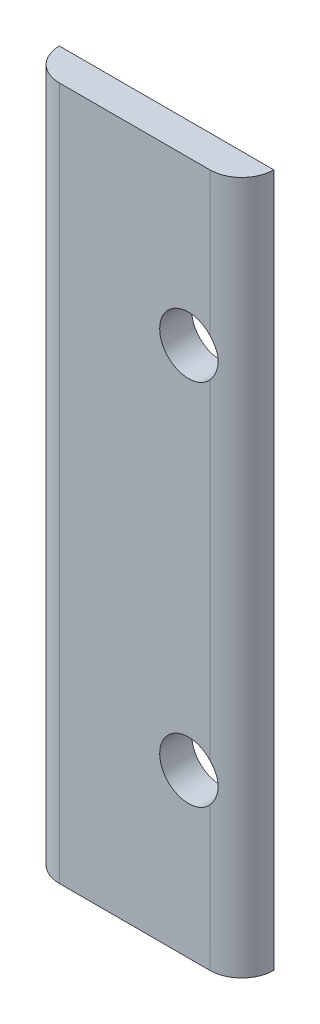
ISO-10303-21;
HEADER;
FILE_DESCRIPTION(('STEP AP214'),'2;1');
FILE_NAME('part.step','',(''),(''),'','','');
FILE_SCHEMA(('AUTOMOTIVE_DESIGN { 1 0 10303 214 1 1 1 1 }'));
ENDSEC;
DATA;
#1=APPLICATION_CONTEXT('core data for automotive mechanical design processes');
#2=APPLICATION_PROTOCOL_DEFINITION('international standard','automotive_design',2000,#1);
#3=PRODUCT_CONTEXT('',#1,'mechanical');
#4=PRODUCT('Part','Part','',(#3));
#5=PRODUCT_RELATED_PRODUCT_CATEGORY('part','',(#4));
#6=PRODUCT_DEFINITION_FORMATION('','',#4);
#7=PRODUCT_DEFINITION_CONTEXT('part definition',#1,'design');
#8=PRODUCT_DEFINITION('design','',#6,#7);
#9=PRODUCT_DEFINITION_SHAPE('','',#8);
#10=(LENGTH_UNIT() NAMED_UNIT(*) SI_UNIT(.MILLI.,.METRE.));
#11=(NAMED_UNIT(*) PLANE_ANGLE_UNIT() SI_UNIT($,.RADIAN.));
#12=(NAMED_UNIT(*) SI_UNIT($,.STERADIAN.) SOLID_ANGLE_UNIT());
#13=UNCERTAINTY_MEASURE_WITH_UNIT(LENGTH_MEASURE(1.E-05),#10,'distance_accuracy_value','');
#14=(GEOMETRIC_REPRESENTATION_CONTEXT(3) GLOBAL_UNCERTAINTY_ASSIGNED_CONTEXT((#13)) GLOBAL_UNIT_ASSIGNED_CONTEXT((#10,
#11,#12)) REPRESENTATION_CONTEXT('',''));
#15=CARTESIAN_POINT('',(0.,0.,0.));
#16=DIRECTION('',(0.,0.,1.));
#17=DIRECTION('',(1.,0.,0.));
#18=AXIS2_PLACEMENT_3D('',#15,#16,#17);
#19=CARTESIAN_POINT('',(60.,32.5,3.));
#20=DIRECTION('',(0.,-1.,0.));
#21=DIRECTION('',(0.,0.,-1.));
#22=AXIS2_PLACEMENT_3D('',#19,#20,#21);
#23=PLANE('',#22);
#24=DIRECTION('',(-1.,0.,0.));
#25=VECTOR('',#24,1.);
#26=CARTESIAN_POINT('',(60.,32.5,0.));
#27=LINE('',#26,#25);
#28=CARTESIAN_POINT('',(60.,32.5,0.));
#29=VERTEX_POINT('',#28);
#30=CARTESIAN_POINT('',(39.8952376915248,32.5,0.));
#31=VERTEX_POINT('',#30);
#32=EDGE_CURVE('E96',#29,#31,#27,.T.);
#33=ORIENTED_EDGE('',*,*,#32,.T.);
#34=CARTESIAN_POINT('',(42.8952376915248,32.5,0.));
#35=DIRECTION('',(0.,-1.,0.));
#36=DIRECTION('',(0.,0.,-1.));
#37=AXIS2_PLACEMENT_3D('',#34,#35,#36);
#38=CIRCLE('',#37,3.);
#39=CARTESIAN_POINT('',(42.8952376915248,32.5,3.));
#40=VERTEX_POINT('',#39);
#41=EDGE_CURVE('E103',#31,#40,#38,.F.);
#42=ORIENTED_EDGE('',*,*,#41,.T.);
#43=DIRECTION('',(-1.,0.,0.));
#44=VECTOR('',#43,1.);
#45=CARTESIAN_POINT('',(60.,32.5,3.));
#46=LINE('',#45,#44);
#47=CARTESIAN_POINT('',(57.,32.5,3.));
#48=VERTEX_POINT('',#47);
#49=EDGE_CURVE('E159',#48,#40,#46,.T.);
#50=ORIENTED_EDGE('',*,*,#49,.F.);
#51=CARTESIAN_POINT('',(57.,32.5,0.));
#52=DIRECTION('',(0.,-1.,0.));
#53=DIRECTION('',(0.,0.,-1.));
#54=AXIS2_PLACEMENT_3D('',#51,#52,#53);
#55=CIRCLE('',#54,3.);
#56=EDGE_CURVE('E106',#48,#29,#55,.F.);
#57=ORIENTED_EDGE('',*,*,#56,.T.);
#58=EDGE_LOOP('',(#33,#42,#50,#57));
#59=FACE_BOUND('',#58,.T.);
#60=ADVANCED_FACE('F33',(#59),#23,.F.);
#61=CARTESIAN_POINT('',(39.8952376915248,-32.5,3.));
#62=DIRECTION('',(0.,1.,0.));
#63=DIRECTION('',(0.,0.,1.));
#64=AXIS2_PLACEMENT_3D('',#61,#62,#63);
#65=PLANE('',#64);
#66=DIRECTION('',(1.,0.,0.));
#67=VECTOR('',#66,1.);
#68=CARTESIAN_POINT('',(39.8952376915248,-32.5,3.));
#69=LINE('',#68,#67);
#70=CARTESIAN_POINT('',(42.8952376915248,-32.5,3.));
#71=VERTEX_POINT('',#70);
#72=CARTESIAN_POINT('',(57.,-32.5,3.));
#73=VERTEX_POINT('',#72);
#74=EDGE_CURVE('E157',#71,#73,#69,.T.);
#75=ORIENTED_EDGE('',*,*,#74,.F.);
#76=CARTESIAN_POINT('',(42.8952376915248,-32.5,0.));
#77=DIRECTION('',(0.,1.,0.));
#78=DIRECTION('',(0.,0.,1.));
#79=AXIS2_PLACEMENT_3D('',#76,#77,#78);
#80=CIRCLE('',#79,3.);
#81=CARTESIAN_POINT('',(39.8952376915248,-32.5,0.));
#82=VERTEX_POINT('',#81);
#83=EDGE_CURVE('E61',#71,#82,#80,.F.);
#84=ORIENTED_EDGE('',*,*,#83,.T.);
#85=DIRECTION('',(1.,0.,0.));
#86=VECTOR('',#85,1.);
#87=CARTESIAN_POINT('',(39.8952376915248,-32.5,0.));
#88=LINE('',#87,#86);
#89=CARTESIAN_POINT('',(60.,-32.5,0.));
#90=VERTEX_POINT('',#89);
#91=EDGE_CURVE('E98',#82,#90,#88,.T.);
#92=ORIENTED_EDGE('',*,*,#91,.T.);
#93=CARTESIAN_POINT('',(57.,-32.5,0.));
#94=DIRECTION('',(0.,1.,0.));
#95=DIRECTION('',(0.,0.,1.));
#96=AXIS2_PLACEMENT_3D('',#93,#94,#95);
#97=CIRCLE('',#96,3.);
#98=EDGE_CURVE('E53',#90,#73,#97,.F.);
#99=ORIENTED_EDGE('',*,*,#98,.T.);
#100=EDGE_LOOP('',(#75,#84,#92,#99));
#101=FACE_BOUND('',#100,.T.);
#102=ADVANCED_FACE('F130',(#101),#65,.F.);
#103=CARTESIAN_POINT('',(0.,0.,3.));
#104=DIRECTION('',(0.,0.,1.));
#105=DIRECTION('',(1.,0.,0.));
#106=AXIS2_PLACEMENT_3D('',#103,#104,#105);
#107=PLANE('',#106);
#108=ORIENTED_EDGE('',*,*,#49,.T.);
#109=DIRECTION('',(0.,-1.,0.));
#110=VECTOR('',#109,1.);
#111=CARTESIAN_POINT('',(42.8952376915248,-32.5,3.));
#112=LINE('',#111,#110);
#113=EDGE_CURVE('E110',#40,#71,#112,.T.);
#114=ORIENTED_EDGE('',*,*,#113,.T.);
#115=ORIENTED_EDGE('',*,*,#74,.T.);
#116=DIRECTION('',(0.,1.,0.));
#117=VECTOR('',#116,1.);
#118=CARTESIAN_POINT('',(57.,32.5,3.));
#119=LINE('',#118,#117);
#120=CARTESIAN_POINT('',(57.,-19.0638357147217,3.));
#121=VERTEX_POINT('',#120);
#122=EDGE_CURVE('E148',#73,#121,#119,.T.);
#123=ORIENTED_EDGE('',*,*,#122,.T.);
#124=CARTESIAN_POINT('',(55.,-17.25,3.));
#125=DIRECTION('',(0.,0.,-1.));
#126=DIRECTION('',(-1.,0.,0.));
#127=AXIS2_PLACEMENT_3D('',#124,#125,#126);
#128=CIRCLE('',#127,2.7);
#129=CARTESIAN_POINT('',(57.,-15.4361642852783,3.));
#130=VERTEX_POINT('',#129);
#131=EDGE_CURVE('E166',#121,#130,#128,.T.);
#132=ORIENTED_EDGE('',*,*,#131,.T.);
#133=DIRECTION('',(0.,1.,0.));
#134=VECTOR('',#133,1.);
#135=CARTESIAN_POINT('',(57.,32.5,3.));
#136=LINE('',#135,#134);
#137=CARTESIAN_POINT('',(57.,15.4361642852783,3.));
#138=VERTEX_POINT('',#137);
#139=EDGE_CURVE('E153',#130,#138,#136,.T.);
#140=ORIENTED_EDGE('',*,*,#139,.T.);
#141=CARTESIAN_POINT('',(55.,17.25,3.));
#142=DIRECTION('',(0.,0.,-1.));
#143=DIRECTION('',(-1.,0.,0.));
#144=AXIS2_PLACEMENT_3D('',#141,#142,#143);
#145=CIRCLE('',#144,2.7);
#146=CARTESIAN_POINT('',(57.,19.0638357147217,3.));
#147=VERTEX_POINT('',#146);
#148=EDGE_CURVE('E107',#138,#147,#145,.T.);
#149=ORIENTED_EDGE('',*,*,#148,.T.);
#150=DIRECTION('',(0.,1.,0.));
#151=VECTOR('',#150,1.);
#152=CARTESIAN_POINT('',(57.,32.5,3.));
#153=LINE('',#152,#151);
#154=EDGE_CURVE('E155',#147,#48,#153,.T.);
#155=ORIENTED_EDGE('',*,*,#154,.T.);
#156=EDGE_LOOP('',(#108,#114,#115,#123,#132,#140,#149,#155));
#157=FACE_BOUND('',#156,.T.);
#158=ADVANCED_FACE('F127',(#157),#107,.T.);
#159=CARTESIAN_POINT('',(0.,0.,0.));
#160=DIRECTION('',(0.,0.,1.));
#161=DIRECTION('',(1.,0.,0.));
#162=AXIS2_PLACEMENT_3D('',#159,#160,#161);
#163=PLANE('',#162);
#164=CARTESIAN_POINT('',(55.,-17.25,0.));
#165=DIRECTION('',(0.,0.,-1.));
#166=DIRECTION('',(-1.,0.,0.));
#167=AXIS2_PLACEMENT_3D('',#164,#165,#166);
#168=CIRCLE('',#167,2.7);
#169=CARTESIAN_POINT('',(52.3,-17.25,0.));
#170=VERTEX_POINT('',#169);
#171=EDGE_CURVE('E169',#170,#170,#168,.T.);
#172=ORIENTED_EDGE('',*,*,#171,.F.);
#173=EDGE_LOOP('',(#172));
#174=FACE_BOUND('',#173,.T.);
#175=CARTESIAN_POINT('',(55.,17.25,0.));
#176=DIRECTION('',(0.,0.,-1.));
#177=DIRECTION('',(-1.,0.,0.));
#178=AXIS2_PLACEMENT_3D('',#175,#176,#177);
#179=CIRCLE('',#178,2.7);
#180=CARTESIAN_POINT('',(52.3,17.25,0.));
#181=VERTEX_POINT('',#180);
#182=EDGE_CURVE('E163',#181,#181,#179,.T.);
#183=ORIENTED_EDGE('',*,*,#182,.F.);
#184=EDGE_LOOP('',(#183));
#185=FACE_BOUND('',#184,.T.);
#186=ORIENTED_EDGE('',*,*,#32,.F.);
#187=DIRECTION('',(0.,1.,0.));
#188=VECTOR('',#187,1.);
#189=CARTESIAN_POINT('',(60.,-32.5,0.));
#190=LINE('',#189,#188);
#191=EDGE_CURVE('E146',#90,#29,#190,.T.);
#192=ORIENTED_EDGE('',*,*,#191,.F.);
#193=ORIENTED_EDGE('',*,*,#91,.F.);
#194=DIRECTION('',(0.,-1.,0.));
#195=VECTOR('',#194,1.);
#196=CARTESIAN_POINT('',(39.8952376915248,32.5,0.));
#197=LINE('',#196,#195);
#198=EDGE_CURVE('E92',#31,#82,#197,.T.);
#199=ORIENTED_EDGE('',*,*,#198,.F.);
#200=EDGE_LOOP('',(#186,#192,#193,#199));
#201=FACE_BOUND('',#200,.T.);
#202=ADVANCED_FACE('F94',(#174,#185,#201),#163,.F.);
#203=CARTESIAN_POINT('',(55.,17.25,3.));
#204=DIRECTION('',(0.,0.,-1.));
#205=DIRECTION('',(-1.,0.,0.));
#206=AXIS2_PLACEMENT_3D('',#203,#204,#205);
#207=CYLINDRICAL_SURFACE('',#206,2.7);
#208=ORIENTED_EDGE('',*,*,#148,.F.);
#209=CARTESIAN_POINT('',(57.,15.4361642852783,3.));
#210=CARTESIAN_POINT('',(57.0507106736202,15.4920778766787,2.99999658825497));
#211=CARTESIAN_POINT('',(57.0990361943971,15.5500792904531,2.9987150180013));
#212=CARTESIAN_POINT('',(57.1906194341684,15.6698514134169,2.99428920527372));
#213=CARTESIAN_POINT('',(57.2338793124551,15.7316204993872,2.99114575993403));
#214=CARTESIAN_POINT('',(57.3556045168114,15.9219319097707,2.97996673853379));
#215=CARTESIAN_POINT('',(57.4261066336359,16.0555792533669,2.97018000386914));
#216=CARTESIAN_POINT('',(57.5438335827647,16.3326219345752,2.95090232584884));
#217=CARTESIAN_POINT('',(57.5910694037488,16.4760126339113,2.94141124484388));
#218=CARTESIAN_POINT('',(57.6610244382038,16.7687940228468,2.92648965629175));
#219=CARTESIAN_POINT('',(57.6837625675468,16.9181799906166,2.92105601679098));
#220=CARTESIAN_POINT('',(57.7040123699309,17.2186654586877,2.9162447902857));
#221=CARTESIAN_POINT('',(57.7015391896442,17.3697638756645,2.91686356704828));
#222=CARTESIAN_POINT('',(57.6714760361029,17.6694090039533,2.92392654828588));
#223=CARTESIAN_POINT('',(57.6438666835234,17.8179536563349,2.9303752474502));
#224=CARTESIAN_POINT('',(57.5649489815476,18.1062101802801,2.94659382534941));
#225=CARTESIAN_POINT('',(57.5139625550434,18.2460136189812,2.95631812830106));
#226=CARTESIAN_POINT('',(57.3897740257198,18.5152620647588,2.97522975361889));
#227=CARTESIAN_POINT('',(57.3166072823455,18.6447231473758,2.98441790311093));
#228=CARTESIAN_POINT('',(57.1979643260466,18.8193729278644,2.9936704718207));
#229=CARTESIAN_POINT('',(57.1607623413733,18.8702088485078,2.99594306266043));
#230=CARTESIAN_POINT('',(57.0829226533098,18.9691230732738,2.99910636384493));
#231=CARTESIAN_POINT('',(57.0422891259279,19.0172046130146,2.99999872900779));
#232=CARTESIAN_POINT('',(57.,19.0638357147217,3.));
#233=B_SPLINE_CURVE_WITH_KNOTS('',3,(#209,#210,#211,#212,#213,#214,#215,#216,#217,#218,#219,
#220,#221,#222,#223,#224,#225,#226,#227,#228,#229,#230,#231,#232),.UNSPECIFIED.,.F.,.F.,(4,2,2,
2,2,2,2,2,2,2,2,4),(0.,0.226277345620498,0.452457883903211,0.904416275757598,1.35616100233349,
1.80755666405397,2.25868114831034,2.71015373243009,3.15558769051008,3.60031524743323,
3.78928090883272,3.97801983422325),.UNSPECIFIED.);
#234=EDGE_CURVE('E11',#138,#147,#233,.T.);
#235=ORIENTED_EDGE('',*,*,#234,.T.);
#236=EDGE_LOOP('',(#208,#235));
#237=FACE_BOUND('',#236,.T.);
#238=ORIENTED_EDGE('',*,*,#182,.T.);
#239=EDGE_LOOP('',(#238));
#240=FACE_BOUND('',#239,.T.);
#241=ADVANCED_FACE('F121',(#237,#240),#207,.F.);
#242=CARTESIAN_POINT('',(55.,-17.25,3.));
#243=DIRECTION('',(0.,0.,-1.));
#244=DIRECTION('',(-1.,0.,0.));
#245=AXIS2_PLACEMENT_3D('',#242,#243,#244);
#246=CYLINDRICAL_SURFACE('',#245,2.7);
#247=ORIENTED_EDGE('',*,*,#131,.F.);
#248=CARTESIAN_POINT('',(57.,-19.0638357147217,3.));
#249=CARTESIAN_POINT('',(57.0507106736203,-19.0079221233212,2.99999658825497));
#250=CARTESIAN_POINT('',(57.0990361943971,-18.9499207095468,2.9987150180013));
#251=CARTESIAN_POINT('',(57.1906194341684,-18.8301485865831,2.99428920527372));
#252=CARTESIAN_POINT('',(57.2338793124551,-18.7683795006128,2.99114575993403));
#253=CARTESIAN_POINT('',(57.3556045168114,-18.5780680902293,2.97996673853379));
#254=CARTESIAN_POINT('',(57.4261066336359,-18.4444207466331,2.97018000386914));
#255=CARTESIAN_POINT('',(57.5438335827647,-18.1673780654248,2.95090232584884));
#256=CARTESIAN_POINT('',(57.5910694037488,-18.0239873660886,2.94141124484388));
#257=CARTESIAN_POINT('',(57.6610244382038,-17.7312059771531,2.92648965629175));
#258=CARTESIAN_POINT('',(57.6837625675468,-17.5818200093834,2.92105601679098));
#259=CARTESIAN_POINT('',(57.7040123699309,-17.2813345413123,2.9162447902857));
#260=CARTESIAN_POINT('',(57.7015391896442,-17.1302361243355,2.91686356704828));
#261=CARTESIAN_POINT('',(57.6714760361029,-16.8305909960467,2.92392654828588));
#262=CARTESIAN_POINT('',(57.6438666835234,-16.6820463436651,2.9303752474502));
#263=CARTESIAN_POINT('',(57.5649489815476,-16.3937898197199,2.94659382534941));
#264=CARTESIAN_POINT('',(57.5139625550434,-16.2539863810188,2.95631812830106));
#265=CARTESIAN_POINT('',(57.3897740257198,-15.9847379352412,2.97522975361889));
#266=CARTESIAN_POINT('',(57.3166072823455,-15.8552768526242,2.98441790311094));
#267=CARTESIAN_POINT('',(57.1979643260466,-15.6806270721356,2.9936704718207));
#268=CARTESIAN_POINT('',(57.1607623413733,-15.6297911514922,2.99594306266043));
#269=CARTESIAN_POINT('',(57.0829226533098,-15.5308769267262,2.99910636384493));
#270=CARTESIAN_POINT('',(57.0422891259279,-15.4827953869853,2.99999872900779));
#271=CARTESIAN_POINT('',(57.,-15.4361642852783,3.));
#272=B_SPLINE_CURVE_WITH_KNOTS('',3,(#248,#249,#250,#251,#252,#253,#254,#255,#256,#257,#258,
#259,#260,#261,#262,#263,#264,#265,#266,#267,#268,#269,#270,#271),.UNSPECIFIED.,.F.,.F.,(4,2,2,
2,2,2,2,2,2,2,2,4),(0.,0.226277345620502,0.452457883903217,0.904416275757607,1.3561610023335,
1.80755666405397,2.25868114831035,2.7101537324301,3.15558769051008,3.60031524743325,
3.78928090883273,3.97801983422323),.UNSPECIFIED.);
#273=EDGE_CURVE('E46',#121,#130,#272,.T.);
#274=ORIENTED_EDGE('',*,*,#273,.T.);
#275=EDGE_LOOP('',(#247,#274));
#276=FACE_BOUND('',#275,.T.);
#277=ORIENTED_EDGE('',*,*,#171,.T.);
#278=EDGE_LOOP('',(#277));
#279=FACE_BOUND('',#278,.T.);
#280=ADVANCED_FACE('F118',(#276,#279),#246,.F.);
#281=CARTESIAN_POINT('',(42.8952376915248,0.,0.));
#282=DIRECTION('',(0.,1.,0.));
#283=DIRECTION('',(0.,0.,1.));
#284=AXIS2_PLACEMENT_3D('',#281,#282,#283);
#285=CYLINDRICAL_SURFACE('',#284,3.);
#286=ORIENTED_EDGE('',*,*,#41,.F.);
#287=ORIENTED_EDGE('',*,*,#198,.T.);
#288=ORIENTED_EDGE('',*,*,#83,.F.);
#289=ORIENTED_EDGE('',*,*,#113,.F.);
#290=EDGE_LOOP('',(#286,#287,#288,#289));
#291=FACE_BOUND('',#290,.T.);
#292=ADVANCED_FACE('F109',(#291),#285,.T.);
#293=CARTESIAN_POINT('',(57.,0.,0.));
#294=DIRECTION('',(0.,-1.,0.));
#295=DIRECTION('',(1.,0.,0.));
#296=AXIS2_PLACEMENT_3D('',#293,#294,#295);
#297=CYLINDRICAL_SURFACE('',#296,3.);
#298=ORIENTED_EDGE('',*,*,#98,.F.);
#299=ORIENTED_EDGE('',*,*,#191,.T.);
#300=ORIENTED_EDGE('',*,*,#56,.F.);
#301=ORIENTED_EDGE('',*,*,#154,.F.);
#302=ORIENTED_EDGE('',*,*,#234,.F.);
#303=ORIENTED_EDGE('',*,*,#139,.F.);
#304=ORIENTED_EDGE('',*,*,#273,.F.);
#305=ORIENTED_EDGE('',*,*,#122,.F.);
#306=EDGE_LOOP('',(#298,#299,#300,#301,#302,#303,#304,#305));
#307=FACE_BOUND('',#306,.T.);
#308=ADVANCED_FACE('F35',(#307),#297,.T.);
#309=CLOSED_SHELL('',(#60,#102,#158,#202,#241,#280,#292,#308));
#310=MANIFOLD_SOLID_BREP('B2',#309);
#311=ADVANCED_BREP_SHAPE_REPRESENTATION('',(#18,#310),#14);
#312=SHAPE_DEFINITION_REPRESENTATION(#9,#311);
ENDSEC;
END-ISO-10303-21;
